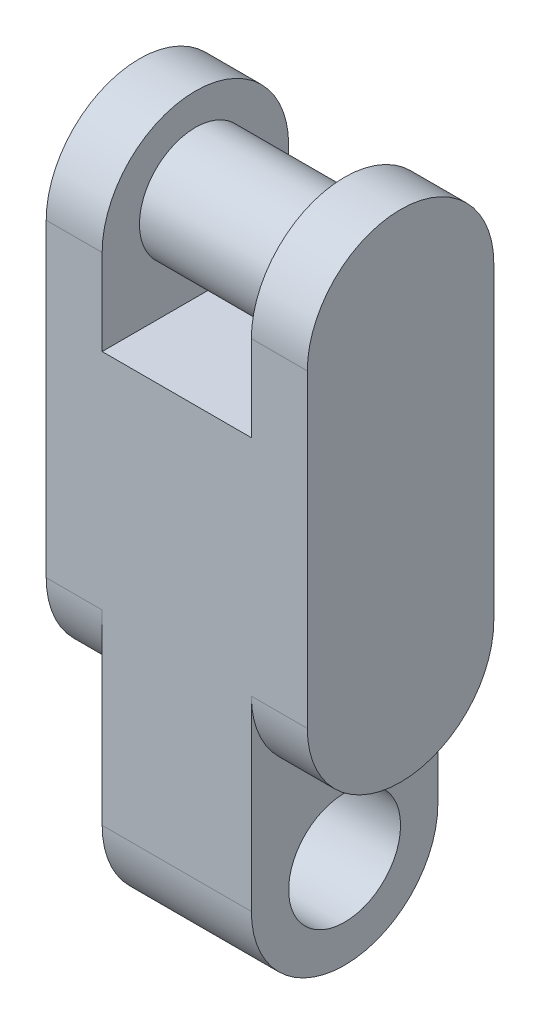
from build123d import *

# Parameters (mm, degrees)
BOSS_EXTRUDE1_DEPTH = 10
SKETCH2_R           = 3
BOSS_EXTRUDE2_DEPTH = 8
SKETCH3_R           = 3
CUT_EXTRUDE1_DEPTH  = 8
CUT_EXTRUDE2_DEPTH  = 21
CUT_EXTRUDE3_DEPTH  = 3
CUT_EXTRUDE4_START  = -3
CUT_EXTRUDE4_DEPTH  = 3


with BuildPart() as part:
    # Sketch1 → Boss-Extrude1 (new body)
    with BuildSketch(Plane.XY):
        Polygon((-58.945014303, 37.045304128), (-58.945014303, 10.445304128), (-55.945014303, 10.445304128), (-55.945014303, 0.445304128), (-47.945014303, 0.445304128), (-47.945014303, 10.445304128), (-44.945014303, 10.445304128), (-44.945014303, 37.045304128), (-47.945014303, 37.045304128), (-47.945014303, 27.446470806), (-55.945014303, 27.446470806), (-55.945014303, 37.045304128), align=None)
    extrude(amount=BOSS_EXTRUDE1_DEPTH)

    # Sketch2 → Boss-Extrude2 (add)
    with BuildSketch(Plane.ZY.offset(47.945014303)):
        with Locations(Location((5, 32.353959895, 0), (0, 0, 180))):
            Circle(SKETCH2_R)
    extrude(amount=BOSS_EXTRUDE2_DEPTH)

    # Sketch3 → Cut-Extrude1 (cut)
    with BuildSketch(Plane(origin=(-47.945014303, 0, 0), x_dir=(0, 0, -1), z_dir=(1, 0, 0))):
        with Locations((-5, 5.445304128)):
            Circle(SKETCH3_R)
        with BuildLine():
            ThreePointArc((-5, 0.445304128), (-8.535533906, 1.909770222), (-10, 5.445304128))
            Line((-10, 5.445304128), (-10, 0.445304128))
            Line((-10, 0.445304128), (-5, 0.445304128))
        make_face()
        with BuildLine():
            Line((0, 0.445304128), (0, 5.445304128))
            ThreePointArc((0, 5.445304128), (-1.464466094, 1.909770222), (-5, 0.445304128))
            Line((-5, 0.445304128), (0, 0.445304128))
        make_face()
    extrude(amount=-CUT_EXTRUDE1_DEPTH, mode=Mode.SUBTRACT)

    # Sketch4 → Cut-Extrude2 (cut)
    with BuildSketch(Plane.ZY.offset(58.945014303)):
        with BuildLine():
            Line((0, 37.045304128), (0, 32.045304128))
            ThreePointArc((0, 32.045304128), (1.464466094, 35.580838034), (5, 37.045304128))
            Line((5, 37.045304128), (0, 37.045304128))
        make_face()
        with BuildLine():
            ThreePointArc((5, 37.045304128), (8.535533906, 35.580838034), (10, 32.045304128))
            Line((10, 32.045304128), (10, 37.045304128))
            Line((10, 37.045304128), (5, 37.045304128))
        make_face()
    extrude(amount=-CUT_EXTRUDE2_DEPTH, mode=Mode.SUBTRACT)

    # Sketch5 → Cut-Extrude3 (cut)
    with BuildSketch(Plane.ZY.offset(58.945014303)):
        with BuildLine():
            ThreePointArc((5, 10.445304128), (1.464466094, 11.909770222), (0, 15.445304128))
            Line((0, 15.445304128), (0, 10.445304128))
            Line((0, 10.445304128), (5, 10.445304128))
        make_face()
        with BuildLine():
            Line((10, 10.445304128), (10, 15.445304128))
            ThreePointArc((10, 15.445304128), (8.535533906, 11.909770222), (5, 10.445304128))
            Line((5, 10.445304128), (10, 10.445304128))
        make_face()
    extrude(amount=-CUT_EXTRUDE3_DEPTH, mode=Mode.SUBTRACT)

    # Sketch6 → Cut-Extrude4 (cut)
    with BuildSketch(Plane(origin=(-44.945014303, 0, 0), x_dir=(0, 0, -1), z_dir=(1, 0, 0)).offset(CUT_EXTRUDE4_START)):
        with BuildLine():
            ThreePointArc((-5, 10.445304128), (-8.535533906, 11.909770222), (-10, 15.445304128))
            Line((-10, 15.445304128), (-10, 10.445304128))
            Line((-10, 10.445304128), (-5, 10.445304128))
        make_face()
        with BuildLine():
            Line((0, 10.445304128), (0, 15.445304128))
            ThreePointArc((0, 15.445304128), (-1.464466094, 11.909770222), (-5, 10.445304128))
            Line((-5, 10.445304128), (0, 10.445304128))
        make_face()
    extrude(amount=CUT_EXTRUDE4_DEPTH, mode=Mode.SUBTRACT)


solid = part.part
